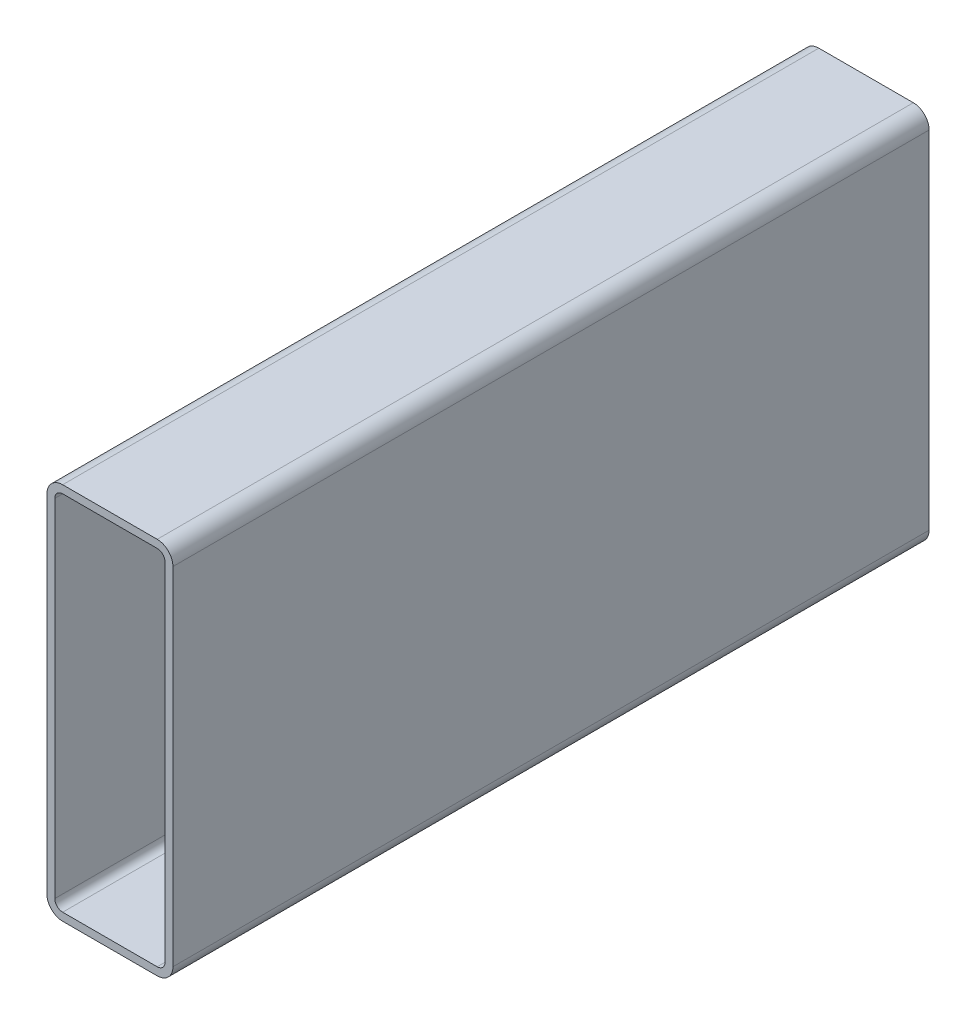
ISO-10303-21;
HEADER;
FILE_DESCRIPTION(('STEP AP214'),'2;1');
FILE_NAME('part.step','',(''),(''),'','','');
FILE_SCHEMA(('AUTOMOTIVE_DESIGN { 1 0 10303 214 1 1 1 1 }'));
ENDSEC;
DATA;
#1=APPLICATION_CONTEXT('core data for automotive mechanical design processes');
#2=APPLICATION_PROTOCOL_DEFINITION('international standard','automotive_design',2000,#1);
#3=PRODUCT_CONTEXT('',#1,'mechanical');
#4=PRODUCT('Part','Part','',(#3));
#5=PRODUCT_RELATED_PRODUCT_CATEGORY('part','',(#4));
#6=PRODUCT_DEFINITION_FORMATION('','',#4);
#7=PRODUCT_DEFINITION_CONTEXT('part definition',#1,'design');
#8=PRODUCT_DEFINITION('design','',#6,#7);
#9=PRODUCT_DEFINITION_SHAPE('','',#8);
#10=(LENGTH_UNIT() NAMED_UNIT(*) SI_UNIT(.MILLI.,.METRE.));
#11=(NAMED_UNIT(*) PLANE_ANGLE_UNIT() SI_UNIT($,.RADIAN.));
#12=(NAMED_UNIT(*) SI_UNIT($,.STERADIAN.) SOLID_ANGLE_UNIT());
#13=UNCERTAINTY_MEASURE_WITH_UNIT(LENGTH_MEASURE(1.E-05),#10,'distance_accuracy_value','');
#14=(GEOMETRIC_REPRESENTATION_CONTEXT(3) GLOBAL_UNCERTAINTY_ASSIGNED_CONTEXT((#13)) GLOBAL_UNIT_ASSIGNED_CONTEXT((#10,
#11,#12)) REPRESENTATION_CONTEXT('',''));
#15=CARTESIAN_POINT('',(0.,0.,0.));
#16=DIRECTION('',(0.,0.,1.));
#17=DIRECTION('',(1.,0.,0.));
#18=AXIS2_PLACEMENT_3D('',#15,#16,#17);
#19=CARTESIAN_POINT('',(6.35,146.05,304.8));
#20=DIRECTION('',(0.,0.,1.));
#21=DIRECTION('',(1.,0.,0.));
#22=AXIS2_PLACEMENT_3D('',#19,#20,#21);
#23=PLANE('',#22);
#24=CARTESIAN_POINT('',(6.35,146.05,304.8));
#25=DIRECTION('',(0.,0.,1.));
#26=DIRECTION('',(1.,0.,0.));
#27=AXIS2_PLACEMENT_3D('',#24,#25,#26);
#28=CIRCLE('',#27,6.35000000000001);
#29=CARTESIAN_POINT('',(6.35,152.4,304.8));
#30=VERTEX_POINT('',#29);
#31=CARTESIAN_POINT('',(0.,146.05,304.8));
#32=VERTEX_POINT('',#31);
#33=EDGE_CURVE('E211',#30,#32,#28,.T.);
#34=ORIENTED_EDGE('',*,*,#33,.T.);
#35=DIRECTION('',(0.,-1.,0.));
#36=VECTOR('',#35,1.);
#37=CARTESIAN_POINT('',(0.,6.35,304.8));
#38=LINE('',#37,#36);
#39=CARTESIAN_POINT('',(0.,6.35,304.8));
#40=VERTEX_POINT('',#39);
#41=EDGE_CURVE('E214',#32,#40,#38,.T.);
#42=ORIENTED_EDGE('',*,*,#41,.T.);
#43=CARTESIAN_POINT('',(6.35,6.35,304.8));
#44=DIRECTION('',(0.,0.,1.));
#45=DIRECTION('',(1.,0.,0.));
#46=AXIS2_PLACEMENT_3D('',#43,#44,#45);
#47=CIRCLE('',#46,6.35);
#48=CARTESIAN_POINT('',(6.35,0.,304.8));
#49=VERTEX_POINT('',#48);
#50=EDGE_CURVE('E217',#40,#49,#47,.T.);
#51=ORIENTED_EDGE('',*,*,#50,.T.);
#52=DIRECTION('',(1.,0.,0.));
#53=VECTOR('',#52,1.);
#54=CARTESIAN_POINT('',(44.45,0.,304.8));
#55=LINE('',#54,#53);
#56=CARTESIAN_POINT('',(44.45,0.,304.8));
#57=VERTEX_POINT('',#56);
#58=EDGE_CURVE('E219',#49,#57,#55,.T.);
#59=ORIENTED_EDGE('',*,*,#58,.T.);
#60=CARTESIAN_POINT('',(44.45,6.35,304.8));
#61=DIRECTION('',(0.,0.,1.));
#62=DIRECTION('',(1.,0.,0.));
#63=AXIS2_PLACEMENT_3D('',#60,#61,#62);
#64=CIRCLE('',#63,6.35);
#65=CARTESIAN_POINT('',(50.8,6.35,304.8));
#66=VERTEX_POINT('',#65);
#67=EDGE_CURVE('E221',#57,#66,#64,.T.);
#68=ORIENTED_EDGE('',*,*,#67,.T.);
#69=DIRECTION('',(0.,1.,0.));
#70=VECTOR('',#69,1.);
#71=CARTESIAN_POINT('',(50.8,146.05,304.8));
#72=LINE('',#71,#70);
#73=CARTESIAN_POINT('',(50.8,146.05,304.8));
#74=VERTEX_POINT('',#73);
#75=EDGE_CURVE('E223',#66,#74,#72,.T.);
#76=ORIENTED_EDGE('',*,*,#75,.T.);
#77=CARTESIAN_POINT('',(44.45,146.05,304.8));
#78=DIRECTION('',(0.,0.,1.));
#79=DIRECTION('',(1.,0.,0.));
#80=AXIS2_PLACEMENT_3D('',#77,#78,#79);
#81=CIRCLE('',#80,6.35000000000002);
#82=CARTESIAN_POINT('',(44.45,152.4,304.8));
#83=VERTEX_POINT('',#82);
#84=EDGE_CURVE('E225',#74,#83,#81,.T.);
#85=ORIENTED_EDGE('',*,*,#84,.T.);
#86=DIRECTION('',(-1.,0.,0.));
#87=VECTOR('',#86,1.);
#88=CARTESIAN_POINT('',(6.35,152.4,304.8));
#89=LINE('',#88,#87);
#90=EDGE_CURVE('E227',#83,#30,#89,.T.);
#91=ORIENTED_EDGE('',*,*,#90,.T.);
#92=EDGE_LOOP('',(#34,#42,#51,#59,#68,#76,#85,#91));
#93=FACE_BOUND('',#92,.T.);
#94=DIRECTION('',(0.,-1.,0.));
#95=VECTOR('',#94,1.);
#96=CARTESIAN_POINT('',(3.175,6.35,304.8));
#97=LINE('',#96,#95);
#98=CARTESIAN_POINT('',(3.175,146.05,304.8));
#99=VERTEX_POINT('',#98);
#100=CARTESIAN_POINT('',(3.175,6.35,304.8));
#101=VERTEX_POINT('',#100);
#102=EDGE_CURVE('E154',#99,#101,#97,.T.);
#103=ORIENTED_EDGE('',*,*,#102,.F.);
#104=CARTESIAN_POINT('',(6.35,146.05,304.8));
#105=DIRECTION('',(0.,0.,1.));
#106=DIRECTION('',(1.,0.,0.));
#107=AXIS2_PLACEMENT_3D('',#104,#105,#106);
#108=CIRCLE('',#107,3.17500000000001);
#109=CARTESIAN_POINT('',(6.35,149.225,304.8));
#110=VERTEX_POINT('',#109);
#111=EDGE_CURVE('E146',#110,#99,#108,.T.);
#112=ORIENTED_EDGE('',*,*,#111,.F.);
#113=DIRECTION('',(-1.,0.,0.));
#114=VECTOR('',#113,1.);
#115=CARTESIAN_POINT('',(6.35,149.225,304.8));
#116=LINE('',#115,#114);
#117=CARTESIAN_POINT('',(44.45,149.225,304.8));
#118=VERTEX_POINT('',#117);
#119=EDGE_CURVE('E179',#118,#110,#116,.T.);
#120=ORIENTED_EDGE('',*,*,#119,.F.);
#121=CARTESIAN_POINT('',(44.45,146.05,304.8));
#122=DIRECTION('',(0.,0.,1.));
#123=DIRECTION('',(1.,0.,0.));
#124=AXIS2_PLACEMENT_3D('',#121,#122,#123);
#125=CIRCLE('',#124,3.17500000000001);
#126=CARTESIAN_POINT('',(47.625,146.05,304.8));
#127=VERTEX_POINT('',#126);
#128=EDGE_CURVE('E177',#127,#118,#125,.T.);
#129=ORIENTED_EDGE('',*,*,#128,.F.);
#130=DIRECTION('',(0.,1.,0.));
#131=VECTOR('',#130,1.);
#132=CARTESIAN_POINT('',(47.625,146.05,304.8));
#133=LINE('',#132,#131);
#134=CARTESIAN_POINT('',(47.625,6.35,304.8));
#135=VERTEX_POINT('',#134);
#136=EDGE_CURVE('E175',#135,#127,#133,.T.);
#137=ORIENTED_EDGE('',*,*,#136,.F.);
#138=CARTESIAN_POINT('',(44.45,6.35,304.8));
#139=DIRECTION('',(0.,0.,1.));
#140=DIRECTION('',(1.,0.,0.));
#141=AXIS2_PLACEMENT_3D('',#138,#139,#140);
#142=CIRCLE('',#141,3.175);
#143=CARTESIAN_POINT('',(44.45,3.175,304.8));
#144=VERTEX_POINT('',#143);
#145=EDGE_CURVE('E173',#144,#135,#142,.T.);
#146=ORIENTED_EDGE('',*,*,#145,.F.);
#147=DIRECTION('',(1.,0.,0.));
#148=VECTOR('',#147,1.);
#149=CARTESIAN_POINT('',(44.45,3.175,304.8));
#150=LINE('',#149,#148);
#151=CARTESIAN_POINT('',(6.35,3.175,304.8));
#152=VERTEX_POINT('',#151);
#153=EDGE_CURVE('E169',#152,#144,#150,.T.);
#154=ORIENTED_EDGE('',*,*,#153,.F.);
#155=CARTESIAN_POINT('',(6.35,6.35,304.8));
#156=DIRECTION('',(0.,0.,1.));
#157=DIRECTION('',(1.,0.,0.));
#158=AXIS2_PLACEMENT_3D('',#155,#156,#157);
#159=CIRCLE('',#158,3.175);
#160=EDGE_CURVE('E167',#101,#152,#159,.T.);
#161=ORIENTED_EDGE('',*,*,#160,.F.);
#162=EDGE_LOOP('',(#103,#112,#120,#129,#137,#146,#154,#161));
#163=FACE_BOUND('',#162,.T.);
#164=ADVANCED_FACE('F33',(#93,#163),#23,.T.);
#165=CARTESIAN_POINT('',(6.35,146.05,0.));
#166=DIRECTION('',(0.,0.,1.));
#167=DIRECTION('',(1.,0.,0.));
#168=AXIS2_PLACEMENT_3D('',#165,#166,#167);
#169=PLANE('',#168);
#170=CARTESIAN_POINT('',(6.35,146.05,0.));
#171=DIRECTION('',(0.,0.,1.));
#172=DIRECTION('',(1.,0.,0.));
#173=AXIS2_PLACEMENT_3D('',#170,#171,#172);
#174=CIRCLE('',#173,6.35000000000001);
#175=CARTESIAN_POINT('',(6.35,152.4,0.));
#176=VERTEX_POINT('',#175);
#177=CARTESIAN_POINT('',(0.,146.05,0.));
#178=VERTEX_POINT('',#177);
#179=EDGE_CURVE('E162',#176,#178,#174,.T.);
#180=ORIENTED_EDGE('',*,*,#179,.F.);
#181=DIRECTION('',(-1.,0.,0.));
#182=VECTOR('',#181,1.);
#183=CARTESIAN_POINT('',(6.35,152.4,0.));
#184=LINE('',#183,#182);
#185=CARTESIAN_POINT('',(44.45,152.4,0.));
#186=VERTEX_POINT('',#185);
#187=EDGE_CURVE('E215',#186,#176,#184,.T.);
#188=ORIENTED_EDGE('',*,*,#187,.F.);
#189=CARTESIAN_POINT('',(44.45,146.05,0.));
#190=DIRECTION('',(0.,0.,1.));
#191=DIRECTION('',(1.,0.,0.));
#192=AXIS2_PLACEMENT_3D('',#189,#190,#191);
#193=CIRCLE('',#192,6.35000000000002);
#194=CARTESIAN_POINT('',(50.8,146.05,0.));
#195=VERTEX_POINT('',#194);
#196=EDGE_CURVE('E242',#195,#186,#193,.T.);
#197=ORIENTED_EDGE('',*,*,#196,.F.);
#198=DIRECTION('',(0.,1.,0.));
#199=VECTOR('',#198,1.);
#200=CARTESIAN_POINT('',(50.8,146.05,0.));
#201=LINE('',#200,#199);
#202=CARTESIAN_POINT('',(50.8,6.35,0.));
#203=VERTEX_POINT('',#202);
#204=EDGE_CURVE('E240',#203,#195,#201,.T.);
#205=ORIENTED_EDGE('',*,*,#204,.F.);
#206=CARTESIAN_POINT('',(44.45,6.35,0.));
#207=DIRECTION('',(0.,0.,1.));
#208=DIRECTION('',(1.,0.,0.));
#209=AXIS2_PLACEMENT_3D('',#206,#207,#208);
#210=CIRCLE('',#209,6.35);
#211=CARTESIAN_POINT('',(44.45,0.,0.));
#212=VERTEX_POINT('',#211);
#213=EDGE_CURVE('E238',#212,#203,#210,.T.);
#214=ORIENTED_EDGE('',*,*,#213,.F.);
#215=DIRECTION('',(1.,0.,0.));
#216=VECTOR('',#215,1.);
#217=CARTESIAN_POINT('',(44.45,0.,0.));
#218=LINE('',#217,#216);
#219=CARTESIAN_POINT('',(6.35,0.,0.));
#220=VERTEX_POINT('',#219);
#221=EDGE_CURVE('E236',#220,#212,#218,.T.);
#222=ORIENTED_EDGE('',*,*,#221,.F.);
#223=CARTESIAN_POINT('',(6.35,6.35,0.));
#224=DIRECTION('',(0.,0.,1.));
#225=DIRECTION('',(1.,0.,0.));
#226=AXIS2_PLACEMENT_3D('',#223,#224,#225);
#227=CIRCLE('',#226,6.35);
#228=CARTESIAN_POINT('',(0.,6.35,0.));
#229=VERTEX_POINT('',#228);
#230=EDGE_CURVE('E234',#229,#220,#227,.T.);
#231=ORIENTED_EDGE('',*,*,#230,.F.);
#232=DIRECTION('',(0.,-1.,0.));
#233=VECTOR('',#232,1.);
#234=CARTESIAN_POINT('',(0.,6.35,0.));
#235=LINE('',#234,#233);
#236=EDGE_CURVE('E232',#178,#229,#235,.T.);
#237=ORIENTED_EDGE('',*,*,#236,.F.);
#238=EDGE_LOOP('',(#180,#188,#197,#205,#214,#222,#231,#237));
#239=FACE_BOUND('',#238,.T.);
#240=CARTESIAN_POINT('',(6.35,146.05,0.));
#241=DIRECTION('',(0.,0.,1.));
#242=DIRECTION('',(1.,0.,0.));
#243=AXIS2_PLACEMENT_3D('',#240,#241,#242);
#244=CIRCLE('',#243,3.17500000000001);
#245=CARTESIAN_POINT('',(6.35,149.225,0.));
#246=VERTEX_POINT('',#245);
#247=CARTESIAN_POINT('',(3.175,146.05,0.));
#248=VERTEX_POINT('',#247);
#249=EDGE_CURVE('E56',#246,#248,#244,.T.);
#250=ORIENTED_EDGE('',*,*,#249,.T.);
#251=DIRECTION('',(0.,-1.,0.));
#252=VECTOR('',#251,1.);
#253=CARTESIAN_POINT('',(3.175,6.35,0.));
#254=LINE('',#253,#252);
#255=CARTESIAN_POINT('',(3.175,6.35,0.));
#256=VERTEX_POINT('',#255);
#257=EDGE_CURVE('E161',#248,#256,#254,.T.);
#258=ORIENTED_EDGE('',*,*,#257,.T.);
#259=CARTESIAN_POINT('',(6.35,6.35,0.));
#260=DIRECTION('',(0.,0.,1.));
#261=DIRECTION('',(1.,0.,0.));
#262=AXIS2_PLACEMENT_3D('',#259,#260,#261);
#263=CIRCLE('',#262,3.175);
#264=CARTESIAN_POINT('',(6.35,3.175,0.));
#265=VERTEX_POINT('',#264);
#266=EDGE_CURVE('E183',#256,#265,#263,.T.);
#267=ORIENTED_EDGE('',*,*,#266,.T.);
#268=DIRECTION('',(1.,0.,0.));
#269=VECTOR('',#268,1.);
#270=CARTESIAN_POINT('',(44.45,3.175,0.));
#271=LINE('',#270,#269);
#272=CARTESIAN_POINT('',(44.45,3.175,0.));
#273=VERTEX_POINT('',#272);
#274=EDGE_CURVE('E186',#265,#273,#271,.T.);
#275=ORIENTED_EDGE('',*,*,#274,.T.);
#276=CARTESIAN_POINT('',(44.45,6.35,0.));
#277=DIRECTION('',(0.,0.,1.));
#278=DIRECTION('',(1.,0.,0.));
#279=AXIS2_PLACEMENT_3D('',#276,#277,#278);
#280=CIRCLE('',#279,3.175);
#281=CARTESIAN_POINT('',(47.625,6.35,0.));
#282=VERTEX_POINT('',#281);
#283=EDGE_CURVE('E189',#273,#282,#280,.T.);
#284=ORIENTED_EDGE('',*,*,#283,.T.);
#285=DIRECTION('',(0.,1.,0.));
#286=VECTOR('',#285,1.);
#287=CARTESIAN_POINT('',(47.625,146.05,0.));
#288=LINE('',#287,#286);
#289=CARTESIAN_POINT('',(47.625,146.05,0.));
#290=VERTEX_POINT('',#289);
#291=EDGE_CURVE('E192',#282,#290,#288,.T.);
#292=ORIENTED_EDGE('',*,*,#291,.T.);
#293=CARTESIAN_POINT('',(44.45,146.05,0.));
#294=DIRECTION('',(0.,0.,1.));
#295=DIRECTION('',(1.,0.,0.));
#296=AXIS2_PLACEMENT_3D('',#293,#294,#295);
#297=CIRCLE('',#296,3.17500000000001);
#298=CARTESIAN_POINT('',(44.45,149.225,0.));
#299=VERTEX_POINT('',#298);
#300=EDGE_CURVE('E195',#290,#299,#297,.T.);
#301=ORIENTED_EDGE('',*,*,#300,.T.);
#302=DIRECTION('',(-1.,0.,0.));
#303=VECTOR('',#302,1.);
#304=CARTESIAN_POINT('',(6.35,149.225,0.));
#305=LINE('',#304,#303);
#306=EDGE_CURVE('E155',#299,#246,#305,.T.);
#307=ORIENTED_EDGE('',*,*,#306,.T.);
#308=EDGE_LOOP('',(#250,#258,#267,#275,#284,#292,#301,#307));
#309=FACE_BOUND('',#308,.T.);
#310=ADVANCED_FACE('F272',(#239,#309),#169,.F.);
#311=CARTESIAN_POINT('',(6.35,146.05,304.8));
#312=DIRECTION('',(0.,0.,-1.));
#313=DIRECTION('',(-1.,0.,0.));
#314=AXIS2_PLACEMENT_3D('',#311,#312,#313);
#315=CYLINDRICAL_SURFACE('',#314,6.35000000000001);
#316=ORIENTED_EDGE('',*,*,#179,.T.);
#317=DIRECTION('',(0.,0.,-1.));
#318=VECTOR('',#317,1.);
#319=CARTESIAN_POINT('',(0.,146.05,304.8));
#320=LINE('',#319,#318);
#321=EDGE_CURVE('E11',#32,#178,#320,.T.);
#322=ORIENTED_EDGE('',*,*,#321,.F.);
#323=ORIENTED_EDGE('',*,*,#33,.F.);
#324=DIRECTION('',(0.,0.,-1.));
#325=VECTOR('',#324,1.);
#326=CARTESIAN_POINT('',(6.35,152.4,304.8));
#327=LINE('',#326,#325);
#328=EDGE_CURVE('E229',#30,#176,#327,.T.);
#329=ORIENTED_EDGE('',*,*,#328,.T.);
#330=EDGE_LOOP('',(#316,#322,#323,#329));
#331=FACE_BOUND('',#330,.T.);
#332=ADVANCED_FACE('F35',(#331),#315,.T.);
#333=CARTESIAN_POINT('',(0.,6.35,304.8));
#334=DIRECTION('',(1.,0.,0.));
#335=DIRECTION('',(0.,0.,-1.));
#336=AXIS2_PLACEMENT_3D('',#333,#334,#335);
#337=PLANE('',#336);
#338=ORIENTED_EDGE('',*,*,#236,.T.);
#339=DIRECTION('',(0.,0.,-1.));
#340=VECTOR('',#339,1.);
#341=CARTESIAN_POINT('',(0.,6.35,304.8));
#342=LINE('',#341,#340);
#343=EDGE_CURVE('E41',#40,#229,#342,.T.);
#344=ORIENTED_EDGE('',*,*,#343,.F.);
#345=ORIENTED_EDGE('',*,*,#41,.F.);
#346=ORIENTED_EDGE('',*,*,#321,.T.);
#347=EDGE_LOOP('',(#338,#344,#345,#346));
#348=FACE_BOUND('',#347,.T.);
#349=ADVANCED_FACE('F289',(#348),#337,.F.);
#350=CARTESIAN_POINT('',(6.35,6.35,304.8));
#351=DIRECTION('',(0.,0.,-1.));
#352=DIRECTION('',(-1.,0.,0.));
#353=AXIS2_PLACEMENT_3D('',#350,#351,#352);
#354=CYLINDRICAL_SURFACE('',#353,6.35);
#355=ORIENTED_EDGE('',*,*,#230,.T.);
#356=DIRECTION('',(0.,0.,-1.));
#357=VECTOR('',#356,1.);
#358=CARTESIAN_POINT('',(6.35,0.,304.8));
#359=LINE('',#358,#357);
#360=EDGE_CURVE('E259',#49,#220,#359,.T.);
#361=ORIENTED_EDGE('',*,*,#360,.F.);
#362=ORIENTED_EDGE('',*,*,#50,.F.);
#363=ORIENTED_EDGE('',*,*,#343,.T.);
#364=EDGE_LOOP('',(#355,#361,#362,#363));
#365=FACE_BOUND('',#364,.T.);
#366=ADVANCED_FACE('F266',(#365),#354,.T.);
#367=CARTESIAN_POINT('',(44.45,0.,304.8));
#368=DIRECTION('',(0.,1.,0.));
#369=DIRECTION('',(0.,0.,1.));
#370=AXIS2_PLACEMENT_3D('',#367,#368,#369);
#371=PLANE('',#370);
#372=ORIENTED_EDGE('',*,*,#221,.T.);
#373=DIRECTION('',(0.,0.,-1.));
#374=VECTOR('',#373,1.);
#375=CARTESIAN_POINT('',(44.45,0.,304.8));
#376=LINE('',#375,#374);
#377=EDGE_CURVE('E256',#57,#212,#376,.T.);
#378=ORIENTED_EDGE('',*,*,#377,.F.);
#379=ORIENTED_EDGE('',*,*,#58,.F.);
#380=ORIENTED_EDGE('',*,*,#360,.T.);
#381=EDGE_LOOP('',(#372,#378,#379,#380));
#382=FACE_BOUND('',#381,.T.);
#383=ADVANCED_FACE('F278',(#382),#371,.F.);
#384=CARTESIAN_POINT('',(44.45,6.35,304.8));
#385=DIRECTION('',(0.,0.,-1.));
#386=DIRECTION('',(-1.,0.,0.));
#387=AXIS2_PLACEMENT_3D('',#384,#385,#386);
#388=CYLINDRICAL_SURFACE('',#387,6.35);
#389=ORIENTED_EDGE('',*,*,#213,.T.);
#390=DIRECTION('',(0.,0.,-1.));
#391=VECTOR('',#390,1.);
#392=CARTESIAN_POINT('',(50.8,6.35,304.8));
#393=LINE('',#392,#391);
#394=EDGE_CURVE('E253',#66,#203,#393,.T.);
#395=ORIENTED_EDGE('',*,*,#394,.F.);
#396=ORIENTED_EDGE('',*,*,#67,.F.);
#397=ORIENTED_EDGE('',*,*,#377,.T.);
#398=EDGE_LOOP('',(#389,#395,#396,#397));
#399=FACE_BOUND('',#398,.T.);
#400=ADVANCED_FACE('F282',(#399),#388,.T.);
#401=CARTESIAN_POINT('',(50.8,146.05,304.8));
#402=DIRECTION('',(-1.,0.,0.));
#403=DIRECTION('',(0.,0.,1.));
#404=AXIS2_PLACEMENT_3D('',#401,#402,#403);
#405=PLANE('',#404);
#406=ORIENTED_EDGE('',*,*,#204,.T.);
#407=DIRECTION('',(0.,0.,-1.));
#408=VECTOR('',#407,1.);
#409=CARTESIAN_POINT('',(50.8,146.05,304.8));
#410=LINE('',#409,#408);
#411=EDGE_CURVE('E250',#74,#195,#410,.T.);
#412=ORIENTED_EDGE('',*,*,#411,.F.);
#413=ORIENTED_EDGE('',*,*,#75,.F.);
#414=ORIENTED_EDGE('',*,*,#394,.T.);
#415=EDGE_LOOP('',(#406,#412,#413,#414));
#416=FACE_BOUND('',#415,.T.);
#417=ADVANCED_FACE('F302',(#416),#405,.F.);
#418=CARTESIAN_POINT('',(44.45,146.05,304.8));
#419=DIRECTION('',(0.,0.,-1.));
#420=DIRECTION('',(-1.,0.,0.));
#421=AXIS2_PLACEMENT_3D('',#418,#419,#420);
#422=CYLINDRICAL_SURFACE('',#421,6.35000000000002);
#423=ORIENTED_EDGE('',*,*,#196,.T.);
#424=DIRECTION('',(0.,0.,-1.));
#425=VECTOR('',#424,1.);
#426=CARTESIAN_POINT('',(44.45,152.4,304.8));
#427=LINE('',#426,#425);
#428=EDGE_CURVE('E247',#83,#186,#427,.T.);
#429=ORIENTED_EDGE('',*,*,#428,.F.);
#430=ORIENTED_EDGE('',*,*,#84,.F.);
#431=ORIENTED_EDGE('',*,*,#411,.T.);
#432=EDGE_LOOP('',(#423,#429,#430,#431));
#433=FACE_BOUND('',#432,.T.);
#434=ADVANCED_FACE('F300',(#433),#422,.T.);
#435=CARTESIAN_POINT('',(6.35,152.4,304.8));
#436=DIRECTION('',(0.,-1.,0.));
#437=DIRECTION('',(0.,0.,-1.));
#438=AXIS2_PLACEMENT_3D('',#435,#436,#437);
#439=PLANE('',#438);
#440=ORIENTED_EDGE('',*,*,#187,.T.);
#441=ORIENTED_EDGE('',*,*,#328,.F.);
#442=ORIENTED_EDGE('',*,*,#90,.F.);
#443=ORIENTED_EDGE('',*,*,#428,.T.);
#444=EDGE_LOOP('',(#440,#441,#442,#443));
#445=FACE_BOUND('',#444,.T.);
#446=ADVANCED_FACE('F295',(#445),#439,.F.);
#447=CARTESIAN_POINT('',(6.35,146.05,304.8));
#448=DIRECTION('',(0.,0.,-1.));
#449=DIRECTION('',(-1.,0.,0.));
#450=AXIS2_PLACEMENT_3D('',#447,#448,#449);
#451=CYLINDRICAL_SURFACE('',#450,3.17500000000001);
#452=ORIENTED_EDGE('',*,*,#249,.F.);
#453=DIRECTION('',(0.,0.,-1.));
#454=VECTOR('',#453,1.);
#455=CARTESIAN_POINT('',(6.35,149.225,304.8));
#456=LINE('',#455,#454);
#457=EDGE_CURVE('E150',#110,#246,#456,.T.);
#458=ORIENTED_EDGE('',*,*,#457,.F.);
#459=ORIENTED_EDGE('',*,*,#111,.T.);
#460=DIRECTION('',(0.,0.,-1.));
#461=VECTOR('',#460,1.);
#462=CARTESIAN_POINT('',(3.175,146.05,304.8));
#463=LINE('',#462,#461);
#464=EDGE_CURVE('E149',#99,#248,#463,.T.);
#465=ORIENTED_EDGE('',*,*,#464,.T.);
#466=EDGE_LOOP('',(#452,#458,#459,#465));
#467=FACE_BOUND('',#466,.T.);
#468=ADVANCED_FACE('F148',(#467),#451,.F.);
#469=CARTESIAN_POINT('',(3.175,6.35,304.8));
#470=DIRECTION('',(1.,0.,0.));
#471=DIRECTION('',(0.,0.,-1.));
#472=AXIS2_PLACEMENT_3D('',#469,#470,#471);
#473=PLANE('',#472);
#474=ORIENTED_EDGE('',*,*,#257,.F.);
#475=ORIENTED_EDGE('',*,*,#464,.F.);
#476=ORIENTED_EDGE('',*,*,#102,.T.);
#477=DIRECTION('',(0.,0.,-1.));
#478=VECTOR('',#477,1.);
#479=CARTESIAN_POINT('',(3.175,6.35,304.8));
#480=LINE('',#479,#478);
#481=EDGE_CURVE('E163',#101,#256,#480,.T.);
#482=ORIENTED_EDGE('',*,*,#481,.T.);
#483=EDGE_LOOP('',(#474,#475,#476,#482));
#484=FACE_BOUND('',#483,.T.);
#485=ADVANCED_FACE('F158',(#484),#473,.T.);
#486=CARTESIAN_POINT('',(6.35,6.35,304.8));
#487=DIRECTION('',(0.,0.,-1.));
#488=DIRECTION('',(-1.,0.,0.));
#489=AXIS2_PLACEMENT_3D('',#486,#487,#488);
#490=CYLINDRICAL_SURFACE('',#489,3.175);
#491=ORIENTED_EDGE('',*,*,#266,.F.);
#492=ORIENTED_EDGE('',*,*,#481,.F.);
#493=ORIENTED_EDGE('',*,*,#160,.T.);
#494=DIRECTION('',(0.,0.,-1.));
#495=VECTOR('',#494,1.);
#496=CARTESIAN_POINT('',(6.35,3.175,304.8));
#497=LINE('',#496,#495);
#498=EDGE_CURVE('E208',#152,#265,#497,.T.);
#499=ORIENTED_EDGE('',*,*,#498,.T.);
#500=EDGE_LOOP('',(#491,#492,#493,#499));
#501=FACE_BOUND('',#500,.T.);
#502=ADVANCED_FACE('F327',(#501),#490,.F.);
#503=CARTESIAN_POINT('',(44.45,3.175,304.8));
#504=DIRECTION('',(0.,1.,0.));
#505=DIRECTION('',(0.,0.,1.));
#506=AXIS2_PLACEMENT_3D('',#503,#504,#505);
#507=PLANE('',#506);
#508=ORIENTED_EDGE('',*,*,#274,.F.);
#509=ORIENTED_EDGE('',*,*,#498,.F.);
#510=ORIENTED_EDGE('',*,*,#153,.T.);
#511=DIRECTION('',(0.,0.,-1.));
#512=VECTOR('',#511,1.);
#513=CARTESIAN_POINT('',(44.45,3.175,304.8));
#514=LINE('',#513,#512);
#515=EDGE_CURVE('E206',#144,#273,#514,.T.);
#516=ORIENTED_EDGE('',*,*,#515,.T.);
#517=EDGE_LOOP('',(#508,#509,#510,#516));
#518=FACE_BOUND('',#517,.T.);
#519=ADVANCED_FACE('F331',(#518),#507,.T.);
#520=CARTESIAN_POINT('',(44.45,6.35,304.8));
#521=DIRECTION('',(0.,0.,-1.));
#522=DIRECTION('',(-1.,0.,0.));
#523=AXIS2_PLACEMENT_3D('',#520,#521,#522);
#524=CYLINDRICAL_SURFACE('',#523,3.175);
#525=ORIENTED_EDGE('',*,*,#283,.F.);
#526=ORIENTED_EDGE('',*,*,#515,.F.);
#527=ORIENTED_EDGE('',*,*,#145,.T.);
#528=DIRECTION('',(0.,0.,-1.));
#529=VECTOR('',#528,1.);
#530=CARTESIAN_POINT('',(47.625,6.35,304.8));
#531=LINE('',#530,#529);
#532=EDGE_CURVE('E204',#135,#282,#531,.T.);
#533=ORIENTED_EDGE('',*,*,#532,.T.);
#534=EDGE_LOOP('',(#525,#526,#527,#533));
#535=FACE_BOUND('',#534,.T.);
#536=ADVANCED_FACE('F337',(#535),#524,.F.);
#537=CARTESIAN_POINT('',(47.625,146.05,304.8));
#538=DIRECTION('',(-1.,0.,0.));
#539=DIRECTION('',(0.,0.,1.));
#540=AXIS2_PLACEMENT_3D('',#537,#538,#539);
#541=PLANE('',#540);
#542=ORIENTED_EDGE('',*,*,#291,.F.);
#543=ORIENTED_EDGE('',*,*,#532,.F.);
#544=ORIENTED_EDGE('',*,*,#136,.T.);
#545=DIRECTION('',(0.,0.,-1.));
#546=VECTOR('',#545,1.);
#547=CARTESIAN_POINT('',(47.625,146.05,304.8));
#548=LINE('',#547,#546);
#549=EDGE_CURVE('E202',#127,#290,#548,.T.);
#550=ORIENTED_EDGE('',*,*,#549,.T.);
#551=EDGE_LOOP('',(#542,#543,#544,#550));
#552=FACE_BOUND('',#551,.T.);
#553=ADVANCED_FACE('F341',(#552),#541,.T.);
#554=CARTESIAN_POINT('',(44.45,146.05,304.8));
#555=DIRECTION('',(0.,0.,-1.));
#556=DIRECTION('',(-1.,0.,0.));
#557=AXIS2_PLACEMENT_3D('',#554,#555,#556);
#558=CYLINDRICAL_SURFACE('',#557,3.17500000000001);
#559=ORIENTED_EDGE('',*,*,#300,.F.);
#560=ORIENTED_EDGE('',*,*,#549,.F.);
#561=ORIENTED_EDGE('',*,*,#128,.T.);
#562=DIRECTION('',(0.,0.,-1.));
#563=VECTOR('',#562,1.);
#564=CARTESIAN_POINT('',(44.45,149.225,304.8));
#565=LINE('',#564,#563);
#566=EDGE_CURVE('E48',#118,#299,#565,.T.);
#567=ORIENTED_EDGE('',*,*,#566,.T.);
#568=EDGE_LOOP('',(#559,#560,#561,#567));
#569=FACE_BOUND('',#568,.T.);
#570=ADVANCED_FACE('F345',(#569),#558,.F.);
#571=CARTESIAN_POINT('',(6.35,149.225,304.8));
#572=DIRECTION('',(0.,-1.,0.));
#573=DIRECTION('',(0.,0.,-1.));
#574=AXIS2_PLACEMENT_3D('',#571,#572,#573);
#575=PLANE('',#574);
#576=ORIENTED_EDGE('',*,*,#306,.F.);
#577=ORIENTED_EDGE('',*,*,#566,.F.);
#578=ORIENTED_EDGE('',*,*,#119,.T.);
#579=ORIENTED_EDGE('',*,*,#457,.T.);
#580=EDGE_LOOP('',(#576,#577,#578,#579));
#581=FACE_BOUND('',#580,.T.);
#582=ADVANCED_FACE('F349',(#581),#575,.T.);
#583=CLOSED_SHELL('',(#164,#310,#332,#349,#366,#383,#400,#417,#434,#446,#468,#485,#502,#519,
#536,#553,#570,#582));
#584=MANIFOLD_SOLID_BREP('B2',#583);
#585=ADVANCED_BREP_SHAPE_REPRESENTATION('',(#18,#584),#14);
#586=SHAPE_DEFINITION_REPRESENTATION(#9,#585);
ENDSEC;
END-ISO-10303-21;
